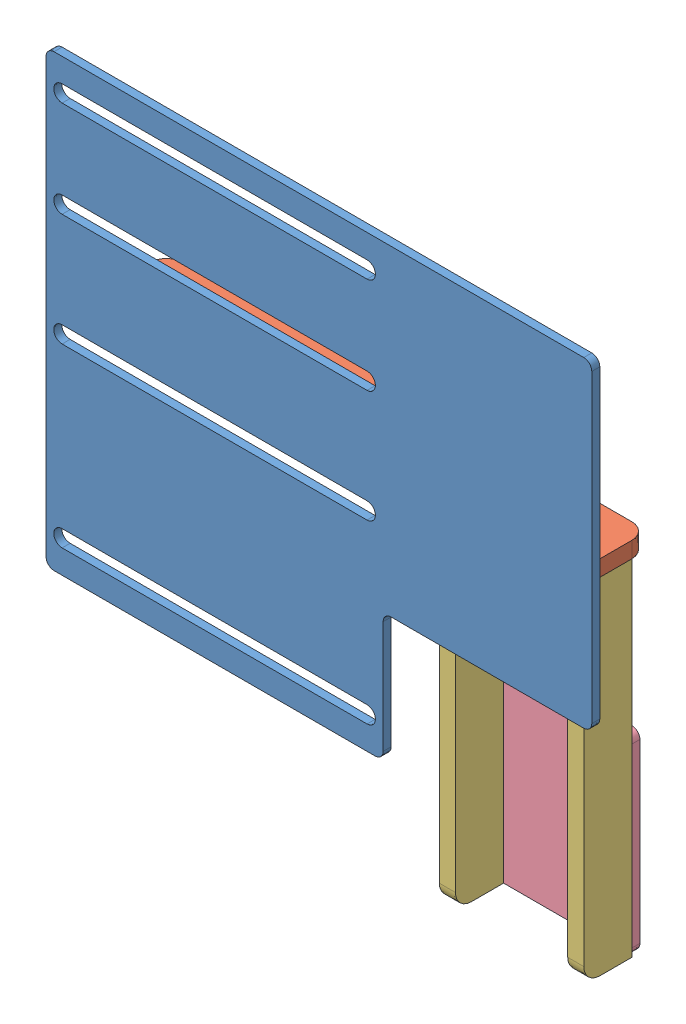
SolidWorks assembly 237603.SLDASM, configuration Default (file format 5000). Lengths in mm.
Overall size (215.9 218.19 25.4).
5 component instances, 4 part files, 15 mates.
Components (placement in the parent):
- 237761-1: 237761.SLDPRT [Default] x (-1 0 0) z (0 0 -1) size (215.9 177.8 3.17)
- 237764-1: 237764.SLDPRT [Default<As Machined>] at (82.55 102.489 -3.175) size (190.5 6.35 19.05)
- 237762-1: 237762.SLDPRT [Default<As Machined>] at (76.2 102.489 -22.225) x (1 0 0) z (0 0 -1) size (6.35 142.88 19.05)
- 237762-3: 237762.SLDPRT [Default<As Machined>] at (25.4 102.489 -22.225) x (1 0 0) z (0 0 -1) size (6.35 142.88 19.05)
- 237763-2: 237763.SLDPRT [Default<As Machined>] at (76.2 -2.2556 -22.225) size (76.2 76.2 3.17)
Mates (geometry in assembly coordinates):
- Coincident5: coincident anti-aligned: plane of 237764-1 through (82.55 99.314 -22.225) normal (0 -1 0); plane of 237762-1 through (76.2 99.314 -3.175) normal (0 1 0)
- Distance6: distance = 6.35 mm aligned: plane of 237764-1 through (82.55 102.489 -22.225) normal (1 0 0); plane of 237762-1 through (76.2 -40.386 -3.175) normal (1 0 0)
- Coincident19: coincident anti-aligned: plane of 237762-1 through (76.2 99.314 -22.225) normal (0 0 -1); plane of 237763-2 through (3.175 32.6694 -22.225) normal (0 0 1)
- Coincident22: coincident aligned: plane of 237762-1 through (76.2 -43.561 -3.175) normal (1 0 0); plane of 237763-2 through (76.2 -37.1806 -25.4) normal (1 0 0)
- Coincident23: coincident aligned: plane of 237762-1 through (76.2 99.314 -22.225) normal (0 0 -1); plane of 237762-3 through (25.4 99.314 -22.225) normal (0 0 -1)
- Coincident24: coincident anti-aligned: plane of 237764-1 through (82.55 99.314 -22.225) normal (0 -1 0); plane of 237762-3 through (25.4 99.314 -3.175) normal (0 1 0)
- Distance7: distance = 57.15 mm aligned: plane of 237764-1 through (82.55 102.489 -22.225) normal (1 0 0); plane of 237762-3 through (25.4 -40.386 -3.175) normal (1 0 0)
- Coincident25: coincident anti-aligned: plane of 237761-1 through (0 0 -3.175) normal (0 0 -1); plane of 237764-1 through (82.55 105.664 -3.175) normal (0 0 1)
- Coincident26: coincident aligned: plane of 237761-1 through (82.55 50.8 -3.175) normal (1 0 0); plane of 237764-1 through (82.55 99.314 -22.225) normal (1 0 0)
- Coincident27: coincident anti-aligned: plane of 237761-1 through (0 0 -3.175) normal (0 0 -1); plane of 237762-3 through (25.4 99.314 -3.175) normal (0 0 1)
- Coincident28: coincident anti-aligned: plane of 237761-1 through (0 0 0) normal (0 0 -1); plane of assembly through (0 0 0) normal (0 0 1)
- Coincident29: coincident aligned: plane of 237761-1; plane of assembly through (0 0 0) normal (0 1 0)
- Coincident30: coincident anti-aligned: plane of 237761-1 through (0 0 0) normal (-1 0 0); plane of assembly through (0 0 0) normal (1 0 0)
- Distance8: distance = 68.961 mm aligned: plane of 237761-1 through (82.55 177.8 -3.175) normal (0 1 0); plane of 237764-1 through (82.55 108.839 -22.225) normal (0 1 0)
- Distance9: distance = 60.198 mm: cylinder of 237763-2 through (7.62 17.277 -22.225) axis (0 0 1) radius 3.2512; cylinder of 237761-1 through (-6.35 82.55 0) axis (0 0 -1) radius 3.302
